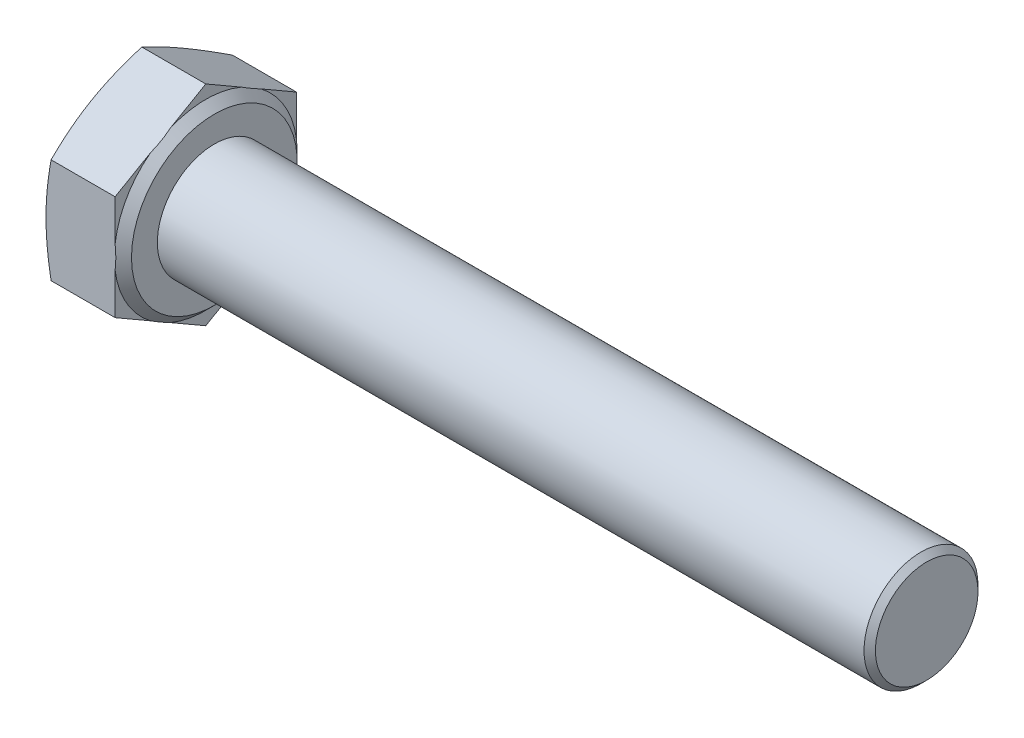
ISO-10303-21;
HEADER;
FILE_DESCRIPTION(('STEP AP214'),'2;1');
FILE_NAME('part.step','',(''),(''),'','','');
FILE_SCHEMA(('AUTOMOTIVE_DESIGN { 1 0 10303 214 1 1 1 1 }'));
ENDSEC;
DATA;
#1=APPLICATION_CONTEXT('core data for automotive mechanical design processes');
#2=APPLICATION_PROTOCOL_DEFINITION('international standard','automotive_design',2000,#1);
#3=PRODUCT_CONTEXT('',#1,'mechanical');
#4=PRODUCT('Part','Part','',(#3));
#5=PRODUCT_RELATED_PRODUCT_CATEGORY('part','',(#4));
#6=PRODUCT_DEFINITION_FORMATION('','',#4);
#7=PRODUCT_DEFINITION_CONTEXT('part definition',#1,'design');
#8=PRODUCT_DEFINITION('design','',#6,#7);
#9=PRODUCT_DEFINITION_SHAPE('','',#8);
#10=(LENGTH_UNIT() NAMED_UNIT(*) SI_UNIT(.MILLI.,.METRE.));
#11=(NAMED_UNIT(*) PLANE_ANGLE_UNIT() SI_UNIT($,.RADIAN.));
#12=(NAMED_UNIT(*) SI_UNIT($,.STERADIAN.) SOLID_ANGLE_UNIT());
#13=UNCERTAINTY_MEASURE_WITH_UNIT(LENGTH_MEASURE(1.E-05),#10,'distance_accuracy_value','');
#14=(GEOMETRIC_REPRESENTATION_CONTEXT(3) GLOBAL_UNCERTAINTY_ASSIGNED_CONTEXT((#13)) GLOBAL_UNIT_ASSIGNED_CONTEXT((#10,
#11,#12)) REPRESENTATION_CONTEXT('',''));
#15=CARTESIAN_POINT('',(0.,0.,0.));
#16=DIRECTION('',(0.,0.,1.));
#17=DIRECTION('',(1.,0.,0.));
#18=AXIS2_PLACEMENT_3D('',#15,#16,#17);
#19=CARTESIAN_POINT('',(5.45,-3.67483446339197,-6.365));
#20=DIRECTION('',(1.,0.,0.));
#21=DIRECTION('',(0.,0.,-1.));
#22=AXIS2_PLACEMENT_3D('',#19,#20,#21);
#23=PLANE('',#22);
#24=CARTESIAN_POINT('',(5.45,0.,0.));
#25=DIRECTION('',(-1.,0.,0.));
#26=DIRECTION('',(0.,0.,1.));
#27=AXIS2_PLACEMENT_3D('',#24,#25,#26);
#28=CIRCLE('',#27,5.815);
#29=CARTESIAN_POINT('',(5.45,0.,5.815));
#30=VERTEX_POINT('',#29);
#31=EDGE_CURVE('E342',#30,#30,#28,.T.);
#32=ORIENTED_EDGE('',*,*,#31,.F.);
#33=EDGE_LOOP('',(#32));
#34=FACE_BOUND('',#33,.T.);
#35=CARTESIAN_POINT('',(5.45,0.,0.));
#36=DIRECTION('',(1.,0.,0.));
#37=DIRECTION('',(0.,0.,-1.));
#38=AXIS2_PLACEMENT_3D('',#35,#36,#37);
#39=CIRCLE('',#38,4.);
#40=CARTESIAN_POINT('',(5.45,0.,-4.));
#41=VERTEX_POINT('',#40);
#42=EDGE_CURVE('E345',#41,#41,#39,.T.);
#43=ORIENTED_EDGE('',*,*,#42,.F.);
#44=EDGE_LOOP('',(#43));
#45=FACE_BOUND('',#44,.T.);
#46=ADVANCED_FACE('F30',(#34,#45),#23,.T.);
#47=CARTESIAN_POINT('',(5.45,-7.34966892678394,0.));
#48=DIRECTION('',(0.,0.866025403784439,0.5));
#49=DIRECTION('',(0.,-0.5,0.866025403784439));
#50=AXIS2_PLACEMENT_3D('',#47,#48,#49);
#51=PLANE('',#50);
#52=CARTESIAN_POINT('',(0.358432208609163,-3.67471899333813,-6.3652));
#53=CARTESIAN_POINT('',(0.303017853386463,-3.82691148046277,-6.10159487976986));
#54=CARTESIAN_POINT('',(0.252608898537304,-3.9796058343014,-5.83712050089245));
#55=CARTESIAN_POINT('',(0.163922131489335,-4.28598738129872,-5.30645209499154));
#56=CARTESIAN_POINT('',(0.125653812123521,-4.43967525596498,-5.0402568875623));
#57=CARTESIAN_POINT('',(0.0637558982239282,-4.74633825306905,-4.50910099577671));
#58=CARTESIAN_POINT('',(0.0399912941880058,-4.8993063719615,-4.24415244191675));
#59=CARTESIAN_POINT('',(0.00811628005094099,-5.2056003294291,-3.71363574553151));
#60=CARTESIAN_POINT('',(0.,-5.35892601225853,-3.44806787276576));
#61=CARTESIAN_POINT('',(0.,-5.66557737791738,-2.91693212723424));
#62=CARTESIAN_POINT('',(0.00811628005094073,-5.81890306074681,-2.65136425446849));
#63=CARTESIAN_POINT('',(0.0399912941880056,-6.12519701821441,-2.12084755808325));
#64=CARTESIAN_POINT('',(0.0637558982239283,-6.27816513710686,-1.85589900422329));
#65=CARTESIAN_POINT('',(0.125653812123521,-6.58482813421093,-1.3247431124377));
#66=CARTESIAN_POINT('',(0.163922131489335,-6.73851600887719,-1.05854790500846));
#67=CARTESIAN_POINT('',(0.252608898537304,-7.04489755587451,-0.527879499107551));
#68=CARTESIAN_POINT('',(0.303017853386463,-7.19759190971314,-0.263405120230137));
#69=CARTESIAN_POINT('',(0.358432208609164,-7.34978439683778,0.000200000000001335));
#70=B_SPLINE_CURVE_WITH_KNOTS('',3,(#52,#53,#54,#55,#56,#57,#58,#59,#60,#61,#62,#63,#64,#65,#66,
#67,#68,#69),.UNSPECIFIED.,.F.,.F.,(4,2,2,2,2,2,2,2,4),(0.,0.928259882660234,1.85724379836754,
2.77744274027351,3.69729643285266,4.6171501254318,5.53734906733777,6.46633298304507,
7.39459286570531),.UNSPECIFIED.);
#71=CARTESIAN_POINT('',(0.358390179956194,-3.67483446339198,-6.365));
#72=VERTEX_POINT('',#71);
#73=CARTESIAN_POINT('',(0.,-5.51225169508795,-3.1825));
#74=VERTEX_POINT('',#73);
#75=EDGE_CURVE('E144',#72,#74,#70,.T.);
#76=ORIENTED_EDGE('',*,*,#75,.F.);
#77=DIRECTION('',(-1.,0.,0.));
#78=VECTOR('',#77,1.);
#79=CARTESIAN_POINT('',(5.45,-3.67483446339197,-6.365));
#80=LINE('',#79,#78);
#81=CARTESIAN_POINT('',(4.85,-3.67483446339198,-6.365));
#82=VERTEX_POINT('',#81);
#83=EDGE_CURVE('E173',#82,#72,#80,.T.);
#84=ORIENTED_EDGE('',*,*,#83,.F.);
#85=DIRECTION('',(0.,0.5,-0.866025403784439));
#86=VECTOR('',#85,1.);
#87=CARTESIAN_POINT('',(4.85,-7.34966892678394,0.));
#88=LINE('',#87,#86);
#89=CARTESIAN_POINT('',(4.85,-5.11256431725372,-3.87477884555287));
#90=VERTEX_POINT('',#89);
#91=EDGE_CURVE('E382',#90,#82,#88,.T.);
#92=ORIENTED_EDGE('',*,*,#91,.F.);
#93=CARTESIAN_POINT('',(4.8498,-5.91274078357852,-2.48883255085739));
#94=CARTESIAN_POINT('',(4.86645104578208,-5.84620990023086,-2.60406742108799));
#95=CARTESIAN_POINT('',(4.8790176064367,-5.77941769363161,-2.71975491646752));
#96=CARTESIAN_POINT('',(4.8957758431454,-5.64583354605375,-2.95112944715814));
#97=CARTESIAN_POINT('',(4.9,-5.57904262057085,-3.06681472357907));
#98=CARTESIAN_POINT('',(4.9,-5.44546076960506,-3.29818527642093));
#99=CARTESIAN_POINT('',(4.8957758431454,-5.37866984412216,-3.41387055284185));
#100=CARTESIAN_POINT('',(4.8790176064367,-5.2450856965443,-3.64524508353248));
#101=CARTESIAN_POINT('',(4.86645104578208,-5.17829348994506,-3.76093257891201));
#102=CARTESIAN_POINT('',(4.8498,-5.11176260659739,-3.87616744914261));
#103=B_SPLINE_CURVE_WITH_KNOTS('',3,(#93,#94,#95,#96,#97,#98,#99,#100,#101,#102),.UNSPECIFIED.,
.F.,.F.,(4,2,2,2,4),(0.,0.402253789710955,0.802938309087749,1.20362282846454,1.6058766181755),.UNSPECIFIED.);
#104=CARTESIAN_POINT('',(4.85,-5.91193907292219,-2.49022115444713));
#105=VERTEX_POINT('',#104);
#106=EDGE_CURVE('E279',#105,#90,#103,.T.);
#107=ORIENTED_EDGE('',*,*,#106,.F.);
#108=CARTESIAN_POINT('',(4.85,-7.34966892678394,0.));
#109=VERTEX_POINT('',#108);
#110=EDGE_CURVE('E387',#109,#105,#88,.T.);
#111=ORIENTED_EDGE('',*,*,#110,.F.);
#112=DIRECTION('',(-1.,0.,0.));
#113=VECTOR('',#112,1.);
#114=CARTESIAN_POINT('',(5.45,-7.34966892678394,0.));
#115=LINE('',#114,#113);
#116=CARTESIAN_POINT('',(0.358390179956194,-7.34966892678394,0.));
#117=VERTEX_POINT('',#116);
#118=EDGE_CURVE('E167',#109,#117,#115,.T.);
#119=ORIENTED_EDGE('',*,*,#118,.T.);
#120=EDGE_CURVE('E198',#74,#117,#70,.T.);
#121=ORIENTED_EDGE('',*,*,#120,.F.);
#122=EDGE_LOOP('',(#76,#84,#92,#107,#111,#119,#121));
#123=FACE_BOUND('',#122,.T.);
#124=ADVANCED_FACE('F213',(#123),#51,.F.);
#125=CARTESIAN_POINT('',(5.45,-3.67483446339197,-6.365));
#126=DIRECTION('',(0.,0.,1.));
#127=DIRECTION('',(0.,-1.,0.));
#128=AXIS2_PLACEMENT_3D('',#125,#126,#127);
#129=PLANE('',#128);
#130=CARTESIAN_POINT('',(1.9150953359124,-9.72967062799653,-6.365));
#131=CARTESIAN_POINT('',(1.82740685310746,-9.44169496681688,-6.365));
#132=CARTESIAN_POINT('',(1.74074158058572,-9.15340194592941,-6.365));
#133=CARTESIAN_POINT('',(1.57002349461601,-8.57601961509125,-6.365));
#134=CARTESIAN_POINT('',(1.48597088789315,-8.28693024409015,-6.365));
#135=CARTESIAN_POINT('',(1.320904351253,-7.70729883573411,-6.365));
#136=CARTESIAN_POINT('',(1.23989638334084,-7.41675509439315,-6.365));
#137=CARTESIAN_POINT('',(1.08186750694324,-6.83458682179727,-6.365));
#138=CARTESIAN_POINT('',(1.0048465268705,-6.54296231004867,-6.365));
#139=CARTESIAN_POINT('',(0.856698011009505,-5.96204179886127,-6.365));
#140=CARTESIAN_POINT('',(0.785509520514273,-5.67276142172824,-6.365));
#141=CARTESIAN_POINT('',(0.64919338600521,-5.09276117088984,-6.365));
#142=CARTESIAN_POINT('',(0.584065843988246,-4.80204127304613,-6.365));
#143=CARTESIAN_POINT('',(0.46138999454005,-4.21909692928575,-6.365));
#144=CARTESIAN_POINT('',(0.40383910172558,-3.92687303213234,-6.365));
#145=CARTESIAN_POINT('',(0.298068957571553,-3.34072867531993,-6.365));
#146=CARTESIAN_POINT('',(0.249849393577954,-3.04680827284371,-6.365));
#147=CARTESIAN_POINT('',(0.169475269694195,-2.49036754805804,-6.365));
#148=CARTESIAN_POINT('',(0.136125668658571,-2.22802146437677,-6.365));
#149=CARTESIAN_POINT('',(0.0796727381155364,-1.70221996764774,-6.365));
#150=CARTESIAN_POINT('',(0.0565691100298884,-1.43876458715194,-6.365));
#151=CARTESIAN_POINT('',(0.0217207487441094,-0.911278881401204,-6.365));
#152=CARTESIAN_POINT('',(0.00996798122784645,-0.64724909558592,-6.365));
#153=CARTESIAN_POINT('',(-0.00158361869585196,-0.11892536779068,-6.365));
#154=CARTESIAN_POINT('',(-0.00138253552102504,0.145368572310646,-6.365));
#155=CARTESIAN_POINT('',(0.0109939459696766,0.675012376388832,-6.365));
#156=CARTESIAN_POINT('',(0.0232300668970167,0.940360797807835,-6.365));
#157=CARTESIAN_POINT('',(0.0591135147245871,1.47027824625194,-6.365));
#158=CARTESIAN_POINT('',(0.0827611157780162,1.73484725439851,-6.365));
#159=CARTESIAN_POINT('',(0.14036130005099,2.26307523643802,-6.365));
#160=CARTESIAN_POINT('',(0.174322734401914,2.52673323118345,-6.365));
#161=CARTESIAN_POINT('',(0.251173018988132,3.0527302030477,-6.365));
#162=CARTESIAN_POINT('',(0.294061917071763,3.31506917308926,-6.365));
#163=CARTESIAN_POINT('',(0.389839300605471,3.85223310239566,-6.365));
#164=CARTESIAN_POINT('',(0.443136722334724,4.12698449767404,-6.365));
#165=CARTESIAN_POINT('',(0.556591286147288,4.67507636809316,-6.365));
#166=CARTESIAN_POINT('',(0.616748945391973,4.94841673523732,-6.365));
#167=CARTESIAN_POINT('',(0.742660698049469,5.49388136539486,-6.365));
#168=CARTESIAN_POINT('',(0.808416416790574,5.7660052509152,-6.365));
#169=CARTESIAN_POINT('',(0.944454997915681,6.30910658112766,-6.365));
#170=CARTESIAN_POINT('',(1.01473775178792,6.58008405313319,-6.365));
#171=CARTESIAN_POINT('',(1.15907513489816,7.1214003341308,-6.365));
#172=CARTESIAN_POINT('',(1.23313447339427,7.39173788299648,-6.365));
#173=CARTESIAN_POINT('',(1.38427063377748,7.93156975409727,-6.365));
#174=CARTESIAN_POINT('',(1.46134750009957,8.20106406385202,-6.365));
#175=CARTESIAN_POINT('',(1.69623888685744,9.00837522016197,-6.365));
#176=CARTESIAN_POINT('',(1.85774082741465,9.5451184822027,-6.365));
#177=CARTESIAN_POINT('',(2.18566531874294,10.6106004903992,-6.365));
#178=CARTESIAN_POINT('',(2.35201388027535,11.1393621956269,-6.365));
#179=CARTESIAN_POINT('',(2.68943698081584,12.1954003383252,-6.365));
#180=CARTESIAN_POINT('',(2.86051174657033,12.7226767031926,-6.365));
#181=CARTESIAN_POINT('',(3.20545948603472,13.7740950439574,-6.365));
#182=CARTESIAN_POINT('',(3.37931937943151,14.298241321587,-6.365));
#183=CARTESIAN_POINT('',(3.64203864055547,15.0837906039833,-6.365));
#184=CARTESIAN_POINT('',(3.72992971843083,15.3455181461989,-6.365));
#185=CARTESIAN_POINT('',(3.90628058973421,15.8687808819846,-6.365));
#186=CARTESIAN_POINT('',(3.99474038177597,16.1303160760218,-6.365));
#187=CARTESIAN_POINT('',(4.08344640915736,16.3917677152,-6.365));
#188=B_SPLINE_CURVE_WITH_KNOTS('',3,(#130,#131,#132,#133,#134,#135,#136,#137,#138,#139,#140,
#141,#142,#143,#144,#145,#146,#147,#148,#149,#150,#151,#152,#153,#154,#155,#156,#157,#158,#159,
#160,#161,#162,#163,#164,#165,#166,#167,#168,#169,#170,#171,#172,#173,#174,#175,#176,#177,#178,
#179,#180,#181,#182,#183,#184,#185,#186,#187),.UNSPECIFIED.,.F.,.F.,(4,2,2,2,2,2,2,2,2,2,2,2,2,
2,2,2,2,2,2,2,2,2,2,2,2,2,2,2,4),(0.,0.903097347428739,1.8062659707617,2.7111196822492,
3.61595714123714,4.50963841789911,5.4033347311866,6.29672529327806,7.19008591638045,
7.98328363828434,8.77645824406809,9.56907101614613,10.361678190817,11.1583050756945,
11.9549510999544,12.7522827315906,13.5496186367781,14.3891305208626,15.2287057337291,
16.0685255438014,16.9083252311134,17.7491990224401,18.5900852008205,20.271552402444,
21.9344598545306,23.5974472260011,25.2541246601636,26.0823966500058,26.9106666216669),.UNSPECIFIED.);
#189=CARTESIAN_POINT('',(0.358390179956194,3.67483446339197,-6.36500000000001));
#190=VERTEX_POINT('',#189);
#191=CARTESIAN_POINT('',(0.,0.,-6.365));
#192=VERTEX_POINT('',#191);
#193=EDGE_CURVE('E258',#190,#192,#188,.F.);
#194=ORIENTED_EDGE('',*,*,#193,.F.);
#195=DIRECTION('',(-1.,0.,0.));
#196=VECTOR('',#195,1.);
#197=CARTESIAN_POINT('',(5.45,3.67483446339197,-6.365));
#198=LINE('',#197,#196);
#199=CARTESIAN_POINT('',(4.85,3.67483446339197,-6.365));
#200=VERTEX_POINT('',#199);
#201=EDGE_CURVE('E164',#200,#190,#198,.T.);
#202=ORIENTED_EDGE('',*,*,#201,.F.);
#203=DIRECTION('',(0.,1.,0.));
#204=VECTOR('',#203,1.);
#205=CARTESIAN_POINT('',(4.85,-3.67483446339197,-6.365));
#206=LINE('',#205,#204);
#207=CARTESIAN_POINT('',(4.85,0.7993747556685,-6.365));
#208=VERTEX_POINT('',#207);
#209=EDGE_CURVE('E388',#208,#200,#206,.T.);
#210=ORIENTED_EDGE('',*,*,#209,.F.);
#211=CARTESIAN_POINT('',(4.03279951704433,-3.43387519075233,-6.365));
#212=CARTESIAN_POINT('',(4.12915263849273,-3.23085023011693,-6.365));
#213=CARTESIAN_POINT('',(4.22025748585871,-3.02511909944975,-6.365));
#214=CARTESIAN_POINT('',(4.38924442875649,-2.607586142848,-6.365));
#215=CARTESIAN_POINT('',(4.46708471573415,-2.39576749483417,-6.365));
#216=CARTESIAN_POINT('',(4.60570873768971,-1.96811964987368,-6.365));
#217=CARTESIAN_POINT('',(4.66660505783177,-1.75232760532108,-6.365));
#218=CARTESIAN_POINT('',(4.76875528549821,-1.31633465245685,-6.365));
#219=CARTESIAN_POINT('',(4.81003455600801,-1.09613982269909,-6.365));
#220=CARTESIAN_POINT('',(4.86166598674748,-0.716857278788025,-6.365));
#221=CARTESIAN_POINT('',(4.87750915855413,-0.558507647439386,-6.365));
#222=CARTESIAN_POINT('',(4.89740688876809,-0.241033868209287,-6.365));
#223=CARTESIAN_POINT('',(4.90146005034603,-0.0819096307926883,-6.365));
#224=CARTESIAN_POINT('',(4.89760366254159,0.236307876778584,-6.365));
#225=CARTESIAN_POINT('',(4.8896854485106,0.395401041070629,-6.365));
#226=CARTESIAN_POINT('',(4.86219166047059,0.712536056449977,-6.365));
#227=CARTESIAN_POINT('',(4.84261749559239,0.870578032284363,-6.365));
#228=CARTESIAN_POINT('',(4.77989629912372,1.26397857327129,-6.365));
#229=CARTESIAN_POINT('',(4.72984501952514,1.49825109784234,-6.365));
#230=CARTESIAN_POINT('',(4.60840439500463,1.96142866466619,-6.365));
#231=CARTESIAN_POINT('',(4.53698240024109,2.19032491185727,-6.365));
#232=CARTESIAN_POINT('',(4.37639278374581,2.64284924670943,-6.365));
#233=CARTESIAN_POINT('',(4.28714977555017,2.86645027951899,-6.365));
#234=CARTESIAN_POINT('',(4.14298757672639,3.1968115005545,-6.365));
#235=CARTESIAN_POINT('',(4.09331043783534,3.30591051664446,-6.365));
#236=CARTESIAN_POINT('',(3.99087238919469,3.52261302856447,-6.365));
#237=CARTESIAN_POINT('',(3.93811240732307,3.63021696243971,-6.365));
#238=CARTESIAN_POINT('',(3.88398571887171,3.73713082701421,-6.365));
#239=B_SPLINE_CURVE_WITH_KNOTS('',3,(#211,#212,#213,#214,#215,#216,#217,#218,#219,#220,#221,
#222,#223,#224,#225,#226,#227,#228,#229,#230,#231,#232,#233,#234,#235,#236,#237,#238),
.UNSPECIFIED.,.F.,.F.,(4,2,2,2,2,2,2,2,2,2,2,2,2,4),(0.,0.67440515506,1.35089815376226,
2.02278254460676,2.69379587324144,3.17081389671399,3.64788843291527,4.1253084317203,
4.60267072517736,5.32008921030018,6.03860940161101,6.76023604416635,7.11982798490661,
7.47931224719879),.UNSPECIFIED.);
#240=CARTESIAN_POINT('',(4.85,-0.799374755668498,-6.365));
#241=VERTEX_POINT('',#240);
#242=EDGE_CURVE('E273',#241,#208,#239,.T.);
#243=ORIENTED_EDGE('',*,*,#242,.F.);
#244=EDGE_CURVE('E384',#82,#241,#206,.T.);
#245=ORIENTED_EDGE('',*,*,#244,.F.);
#246=ORIENTED_EDGE('',*,*,#83,.T.);
#247=EDGE_CURVE('E155',#192,#72,#188,.F.);
#248=ORIENTED_EDGE('',*,*,#247,.F.);
#249=EDGE_LOOP('',(#194,#202,#210,#243,#245,#246,#248));
#250=FACE_BOUND('',#249,.T.);
#251=ADVANCED_FACE('F265',(#250),#129,.F.);
#252=CARTESIAN_POINT('',(5.45,3.67483446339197,-6.365));
#253=DIRECTION('',(0.,-0.866025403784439,0.5));
#254=DIRECTION('',(0.,-0.5,-0.866025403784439));
#255=AXIS2_PLACEMENT_3D('',#252,#253,#254);
#256=PLANE('',#255);
#257=CARTESIAN_POINT('',(0.358432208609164,7.34978439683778,0.000200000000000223));
#258=CARTESIAN_POINT('',(0.303017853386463,7.19759190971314,-0.263405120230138));
#259=CARTESIAN_POINT('',(0.252608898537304,7.04489755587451,-0.527879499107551));
#260=CARTESIAN_POINT('',(0.163922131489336,6.73851600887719,-1.05854790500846));
#261=CARTESIAN_POINT('',(0.125653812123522,6.58482813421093,-1.3247431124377));
#262=CARTESIAN_POINT('',(0.0637558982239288,6.27816513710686,-1.85589900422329));
#263=CARTESIAN_POINT('',(0.0399912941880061,6.12519701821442,-2.12084755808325));
#264=CARTESIAN_POINT('',(0.00811628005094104,5.81890306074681,-2.65136425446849));
#265=CARTESIAN_POINT('',(0.,5.66557737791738,-2.91693212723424));
#266=CARTESIAN_POINT('',(0.,5.35892601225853,-3.44806787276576));
#267=CARTESIAN_POINT('',(0.00811628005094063,5.2056003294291,-3.71363574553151));
#268=CARTESIAN_POINT('',(0.0399912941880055,4.8993063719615,-4.24415244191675));
#269=CARTESIAN_POINT('',(0.0637558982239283,4.74633825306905,-4.50910099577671));
#270=CARTESIAN_POINT('',(0.125653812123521,4.43967525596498,-5.0402568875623));
#271=CARTESIAN_POINT('',(0.163922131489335,4.28598738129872,-5.30645209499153));
#272=CARTESIAN_POINT('',(0.252608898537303,3.9796058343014,-5.83712050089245));
#273=CARTESIAN_POINT('',(0.303017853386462,3.82691148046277,-6.10159487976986));
#274=CARTESIAN_POINT('',(0.358432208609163,3.67471899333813,-6.3652));
#275=B_SPLINE_CURVE_WITH_KNOTS('',3,(#257,#258,#259,#260,#261,#262,#263,#264,#265,#266,#267,
#268,#269,#270,#271,#272,#273,#274),.UNSPECIFIED.,.F.,.F.,(4,2,2,2,2,2,2,2,4),(0.,
0.928259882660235,1.85724379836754,2.77744274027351,3.69729643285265,4.6171501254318,
5.53734906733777,6.46633298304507,7.39459286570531),.UNSPECIFIED.);
#276=CARTESIAN_POINT('',(0.358390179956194,7.34966892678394,0.));
#277=VERTEX_POINT('',#276);
#278=CARTESIAN_POINT('',(0.,5.51225169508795,-3.1825));
#279=VERTEX_POINT('',#278);
#280=EDGE_CURVE('E45',#277,#279,#275,.T.);
#281=ORIENTED_EDGE('',*,*,#280,.F.);
#282=DIRECTION('',(-1.,0.,0.));
#283=VECTOR('',#282,1.);
#284=CARTESIAN_POINT('',(5.45,7.34966892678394,0.));
#285=LINE('',#284,#283);
#286=CARTESIAN_POINT('',(4.85,7.34966892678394,0.));
#287=VERTEX_POINT('',#286);
#288=EDGE_CURVE('E161',#287,#277,#285,.T.);
#289=ORIENTED_EDGE('',*,*,#288,.F.);
#290=DIRECTION('',(0.,0.5,0.866025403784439));
#291=VECTOR('',#290,1.);
#292=CARTESIAN_POINT('',(4.85,3.67483446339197,-6.365));
#293=LINE('',#292,#291);
#294=CARTESIAN_POINT('',(4.85,5.91193907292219,-2.49022115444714));
#295=VERTEX_POINT('',#294);
#296=EDGE_CURVE('E412',#295,#287,#293,.T.);
#297=ORIENTED_EDGE('',*,*,#296,.F.);
#298=CARTESIAN_POINT('',(4.8498,5.11176260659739,-3.87616744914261));
#299=CARTESIAN_POINT('',(4.86645104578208,5.17829348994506,-3.76093257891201));
#300=CARTESIAN_POINT('',(4.8790176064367,5.2450856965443,-3.64524508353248));
#301=CARTESIAN_POINT('',(4.8957758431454,5.37866984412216,-3.41387055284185));
#302=CARTESIAN_POINT('',(4.9,5.44546076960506,-3.29818527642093));
#303=CARTESIAN_POINT('',(4.9,5.57904262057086,-3.06681472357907));
#304=CARTESIAN_POINT('',(4.8957758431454,5.64583354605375,-2.95112944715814));
#305=CARTESIAN_POINT('',(4.8790176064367,5.77941769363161,-2.71975491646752));
#306=CARTESIAN_POINT('',(4.86645104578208,5.84620990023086,-2.60406742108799));
#307=CARTESIAN_POINT('',(4.8498,5.91274078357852,-2.48883255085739));
#308=B_SPLINE_CURVE_WITH_KNOTS('',3,(#298,#299,#300,#301,#302,#303,#304,#305,#306,#307),
.UNSPECIFIED.,.F.,.F.,(4,2,2,2,4),(0.,0.402253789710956,0.80293830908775,1.20362282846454,
1.6058766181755),.UNSPECIFIED.);
#309=CARTESIAN_POINT('',(4.85,5.11256431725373,-3.87477884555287));
#310=VERTEX_POINT('',#309);
#311=EDGE_CURVE('E280',#310,#295,#308,.T.);
#312=ORIENTED_EDGE('',*,*,#311,.F.);
#313=EDGE_CURVE('E407',#200,#310,#293,.T.);
#314=ORIENTED_EDGE('',*,*,#313,.F.);
#315=ORIENTED_EDGE('',*,*,#201,.T.);
#316=EDGE_CURVE('E259',#279,#190,#275,.T.);
#317=ORIENTED_EDGE('',*,*,#316,.F.);
#318=EDGE_LOOP('',(#281,#289,#297,#312,#314,#315,#317));
#319=FACE_BOUND('',#318,.T.);
#320=ADVANCED_FACE('F268',(#319),#256,.F.);
#321=CARTESIAN_POINT('',(5.45,7.34966892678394,0.));
#322=DIRECTION('',(0.,-0.866025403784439,-0.5));
#323=DIRECTION('',(0.,0.5,-0.866025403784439));
#324=AXIS2_PLACEMENT_3D('',#321,#322,#323);
#325=PLANE('',#324);
#326=CARTESIAN_POINT('',(0.358432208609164,3.67471899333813,6.3652));
#327=CARTESIAN_POINT('',(0.303017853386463,3.82691148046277,6.10159487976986));
#328=CARTESIAN_POINT('',(0.252608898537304,3.9796058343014,5.83712050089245));
#329=CARTESIAN_POINT('',(0.163922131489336,4.28598738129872,5.30645209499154));
#330=CARTESIAN_POINT('',(0.125653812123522,4.43967525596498,5.0402568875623));
#331=CARTESIAN_POINT('',(0.0637558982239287,4.74633825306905,4.50910099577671));
#332=CARTESIAN_POINT('',(0.0399912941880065,4.8993063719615,4.24415244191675));
#333=CARTESIAN_POINT('',(0.00811628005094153,5.2056003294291,3.71363574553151));
#334=CARTESIAN_POINT('',(0.,5.35892601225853,3.44806787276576));
#335=CARTESIAN_POINT('',(0.,5.66557737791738,2.91693212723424));
#336=CARTESIAN_POINT('',(0.0081162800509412,5.81890306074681,2.65136425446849));
#337=CARTESIAN_POINT('',(0.0399912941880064,6.12519701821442,2.12084755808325));
#338=CARTESIAN_POINT('',(0.0637558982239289,6.27816513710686,1.85589900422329));
#339=CARTESIAN_POINT('',(0.125653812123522,6.58482813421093,1.3247431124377));
#340=CARTESIAN_POINT('',(0.163922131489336,6.73851600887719,1.05854790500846));
#341=CARTESIAN_POINT('',(0.252608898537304,7.04489755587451,0.527879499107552));
#342=CARTESIAN_POINT('',(0.303017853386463,7.19759190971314,0.263405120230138));
#343=CARTESIAN_POINT('',(0.358432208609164,7.34978439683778,-0.00020000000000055));
#344=B_SPLINE_CURVE_WITH_KNOTS('',3,(#326,#327,#328,#329,#330,#331,#332,#333,#334,#335,#336,
#337,#338,#339,#340,#341,#342,#343),.UNSPECIFIED.,.F.,.F.,(4,2,2,2,2,2,2,2,4),(0.,
0.928259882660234,1.85724379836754,2.77744274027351,3.69729643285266,4.6171501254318,
5.53734906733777,6.46633298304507,7.39459286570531),.UNSPECIFIED.);
#345=CARTESIAN_POINT('',(0.358390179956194,3.67483446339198,6.365));
#346=VERTEX_POINT('',#345);
#347=CARTESIAN_POINT('',(0.,5.51225169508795,3.1825));
#348=VERTEX_POINT('',#347);
#349=EDGE_CURVE('E53',#346,#348,#344,.T.);
#350=ORIENTED_EDGE('',*,*,#349,.F.);
#351=DIRECTION('',(-1.,0.,0.));
#352=VECTOR('',#351,1.);
#353=CARTESIAN_POINT('',(5.45,3.67483446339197,6.365));
#354=LINE('',#353,#352);
#355=CARTESIAN_POINT('',(4.85,3.67483446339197,6.365));
#356=VERTEX_POINT('',#355);
#357=EDGE_CURVE('E152',#356,#346,#354,.T.);
#358=ORIENTED_EDGE('',*,*,#357,.F.);
#359=DIRECTION('',(0.,-0.5,0.866025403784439));
#360=VECTOR('',#359,1.);
#361=CARTESIAN_POINT('',(4.85,7.34966892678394,0.));
#362=LINE('',#361,#360);
#363=CARTESIAN_POINT('',(4.85,5.11256431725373,3.87477884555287));
#364=VERTEX_POINT('',#363);
#365=EDGE_CURVE('E419',#364,#356,#362,.T.);
#366=ORIENTED_EDGE('',*,*,#365,.F.);
#367=CARTESIAN_POINT('',(4.8498,5.91274078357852,2.48883255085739));
#368=CARTESIAN_POINT('',(4.86645104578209,5.84620990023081,2.60406742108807));
#369=CARTESIAN_POINT('',(4.87901760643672,5.77941769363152,2.71975491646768));
#370=CARTESIAN_POINT('',(4.89577584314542,5.64583354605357,2.95112944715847));
#371=CARTESIAN_POINT('',(4.90000000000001,5.57904262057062,3.06681472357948));
#372=CARTESIAN_POINT('',(4.89999999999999,5.44546076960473,3.29818527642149));
#373=CARTESIAN_POINT('',(4.89577584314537,5.37866984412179,3.4138705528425));
#374=CARTESIAN_POINT('',(4.87901760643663,5.24508569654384,3.64524508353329));
#375=CARTESIAN_POINT('',(4.86645104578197,5.17829348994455,3.7609325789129));
#376=CARTESIAN_POINT('',(4.84979999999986,5.11176260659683,3.87616744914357));
#377=B_SPLINE_CURVE_WITH_KNOTS('',3,(#367,#368,#369,#370,#371,#372,#373,#374,#375,#376),
.UNSPECIFIED.,.F.,.F.,(4,2,2,2,4),(0.,0.402253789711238,0.802938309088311,1.20362282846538,
1.60587661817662),.UNSPECIFIED.);
#378=CARTESIAN_POINT('',(4.85,5.91193907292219,2.49022115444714));
#379=VERTEX_POINT('',#378);
#380=EDGE_CURVE('E312',#379,#364,#377,.T.);
#381=ORIENTED_EDGE('',*,*,#380,.F.);
#382=EDGE_CURVE('E418',#287,#379,#362,.T.);
#383=ORIENTED_EDGE('',*,*,#382,.F.);
#384=ORIENTED_EDGE('',*,*,#288,.T.);
#385=EDGE_CURVE('E154',#348,#277,#344,.T.);
#386=ORIENTED_EDGE('',*,*,#385,.F.);
#387=EDGE_LOOP('',(#350,#358,#366,#381,#383,#384,#386));
#388=FACE_BOUND('',#387,.T.);
#389=ADVANCED_FACE('F150',(#388),#325,.F.);
#390=CARTESIAN_POINT('',(5.45,3.67483446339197,6.365));
#391=DIRECTION('',(0.,0.,-1.));
#392=DIRECTION('',(-1.,0.,0.));
#393=AXIS2_PLACEMENT_3D('',#390,#391,#392);
#394=PLANE('',#393);
#395=CARTESIAN_POINT('',(1.91509499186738,-9.72966949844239,6.365));
#396=CARTESIAN_POINT('',(1.8274065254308,-9.44169388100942,6.365));
#397=CARTESIAN_POINT('',(1.74074126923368,-9.15340090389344,6.365));
#398=CARTESIAN_POINT('',(1.57002321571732,-8.57601866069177,6.365));
#399=CARTESIAN_POINT('',(1.48597062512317,-8.28692933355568,6.365));
#400=CARTESIAN_POINT('',(1.32090412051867,-7.70729801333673,6.365));
#401=CARTESIAN_POINT('',(1.23989616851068,-7.41675431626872,6.365));
#402=CARTESIAN_POINT('',(1.08186732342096,-6.83458613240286,6.365));
#403=CARTESIAN_POINT('',(1.00484635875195,-6.54296166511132,6.365));
#404=CARTESIAN_POINT('',(0.856697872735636,-5.96204124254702,6.365));
#405=CARTESIAN_POINT('',(0.785509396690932,-5.67276090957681,6.365));
#406=CARTESIAN_POINT('',(0.64919328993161,-5.09276074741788,6.365));
#407=CARTESIAN_POINT('',(0.584065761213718,-4.80204089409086,6.365));
#408=CARTESIAN_POINT('',(0.461389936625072,-4.21909663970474,6.365));
#409=CARTESIAN_POINT('',(0.403839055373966,-3.92687278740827,6.365));
#410=CARTESIAN_POINT('',(0.2980689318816,-3.34072852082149,6.365));
#411=CARTESIAN_POINT('',(0.249849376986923,-3.04680816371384,6.365));
#412=CARTESIAN_POINT('',(0.169475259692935,-2.49036747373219,6.365));
#413=CARTESIAN_POINT('',(0.136125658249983,-2.22802137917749,6.365));
#414=CARTESIAN_POINT('',(0.0796727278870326,-1.7022198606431,6.365));
#415=CARTESIAN_POINT('',(0.0565691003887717,-1.43876446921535,6.365));
#416=CARTESIAN_POINT('',(0.021720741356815,-0.911278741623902,6.365));
#417=CARTESIAN_POINT('',(0.00996797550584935,-0.647248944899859,6.365));
#418=CARTESIAN_POINT('',(-0.00158362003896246,-0.118925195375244,6.365));
#419=CARTESIAN_POINT('',(-0.00138253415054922,0.145368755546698,6.365));
#420=CARTESIAN_POINT('',(0.0109939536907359,0.675012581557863,6.365));
#421=CARTESIAN_POINT('',(0.0232300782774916,0.940361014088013,6.365));
#422=CARTESIAN_POINT('',(0.05911353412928,1.4702784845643,6.365));
#423=CARTESIAN_POINT('',(0.0827611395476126,1.7348475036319,6.365));
#424=CARTESIAN_POINT('',(0.140361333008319,2.26307550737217,6.365));
#425=CARTESIAN_POINT('',(0.174322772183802,2.52673351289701,6.365));
#426=CARTESIAN_POINT('',(0.251173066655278,3.05273050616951,6.365));
#427=CARTESIAN_POINT('',(0.294061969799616,3.3150694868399,6.365));
#428=CARTESIAN_POINT('',(0.389839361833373,3.85223342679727,6.365));
#429=CARTESIAN_POINT('',(0.443136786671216,4.1269848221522,6.365));
#430=CARTESIAN_POINT('',(0.556591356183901,4.6750766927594,6.365));
#431=CARTESIAN_POINT('',(0.616749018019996,4.94841706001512,6.365));
#432=CARTESIAN_POINT('',(0.742660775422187,5.49388169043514,6.365));
#433=CARTESIAN_POINT('',(0.808416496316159,5.76600557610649,6.365));
#434=CARTESIAN_POINT('',(0.944455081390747,6.30910690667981,6.365));
#435=CARTESIAN_POINT('',(1.01473783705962,6.58008437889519,6.365));
#436=CARTESIAN_POINT('',(1.15907522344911,7.12140066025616,6.365));
#437=CARTESIAN_POINT('',(1.23313456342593,7.39173820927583,6.365));
#438=CARTESIAN_POINT('',(1.38427072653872,7.93157008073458,6.365));
#439=CARTESIAN_POINT('',(1.46134759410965,8.20106439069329,6.365));
#440=CARTESIAN_POINT('',(1.6962389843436,9.00837554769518,6.365));
#441=CARTESIAN_POINT('',(1.85774092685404,9.54511881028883,6.365));
#442=CARTESIAN_POINT('',(2.18566542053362,10.6106008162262,6.365));
#443=CARTESIAN_POINT('',(2.35201398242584,11.1393625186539,6.365));
#444=CARTESIAN_POINT('',(2.6894370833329,12.1954006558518,6.365));
#445=CARTESIAN_POINT('',(2.86051184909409,12.7226770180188,6.365));
#446=CARTESIAN_POINT('',(3.2054595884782,13.7740953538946,6.365));
#447=CARTESIAN_POINT('',(3.37931948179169,14.2982416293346,6.365));
#448=CARTESIAN_POINT('',(3.64203874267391,15.0837909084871,6.365));
#449=CARTESIAN_POINT('',(3.72992982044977,15.3455184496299,6.365));
#450=CARTESIAN_POINT('',(3.90628069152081,15.8687811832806,6.365));
#451=CARTESIAN_POINT('',(3.99474048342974,16.1303163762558,6.365));
#452=CARTESIAN_POINT('',(4.08344651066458,16.3917680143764,6.365));
#453=B_SPLINE_CURVE_WITH_KNOTS('',3,(#395,#396,#397,#398,#399,#400,#401,#402,#403,#404,#405,
#406,#407,#408,#409,#410,#411,#412,#413,#414,#415,#416,#417,#418,#419,#420,#421,#422,#423,#424,
#425,#426,#427,#428,#429,#430,#431,#432,#433,#434,#435,#436,#437,#438,#439,#440,#441,#442,#443,
#444,#445,#446,#447,#448,#449,#450,#451,#452),.UNSPECIFIED.,.F.,.F.,(4,2,2,2,2,2,2,2,2,2,2,2,2,
2,2,2,2,2,2,2,2,2,2,2,2,2,2,2,4),(0.,0.903097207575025,1.80626569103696,2.71111926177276,
3.61595658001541,4.50963771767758,5.40333389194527,6.29672431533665,7.19008479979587,
7.98328255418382,8.77645719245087,9.56906999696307,10.3616772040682,11.1583041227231,
11.9549501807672,12.7522818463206,13.5496177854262,14.3891296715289,15.2287048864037,
16.0685246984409,16.9083243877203,17.7491981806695,18.5900843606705,20.2715515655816,
21.9344590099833,23.5974463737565,25.2541238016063,26.0823957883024,26.9106657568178),.UNSPECIFIED.);
#454=CARTESIAN_POINT('',(0.358390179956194,-3.67483446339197,6.36500000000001));
#455=VERTEX_POINT('',#454);
#456=CARTESIAN_POINT('',(0.,0.,6.365));
#457=VERTEX_POINT('',#456);
#458=EDGE_CURVE('E146',#455,#457,#453,.T.);
#459=ORIENTED_EDGE('',*,*,#458,.F.);
#460=DIRECTION('',(-1.,0.,0.));
#461=VECTOR('',#460,1.);
#462=CARTESIAN_POINT('',(5.45,-3.67483446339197,6.365));
#463=LINE('',#462,#461);
#464=CARTESIAN_POINT('',(4.85,-3.67483446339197,6.36500000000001));
#465=VERTEX_POINT('',#464);
#466=EDGE_CURVE('E162',#465,#455,#463,.T.);
#467=ORIENTED_EDGE('',*,*,#466,.F.);
#468=DIRECTION('',(0.,-1.,0.));
#469=VECTOR('',#468,1.);
#470=CARTESIAN_POINT('',(4.85,3.67483446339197,6.365));
#471=LINE('',#470,#469);
#472=CARTESIAN_POINT('',(4.85,-0.799374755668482,6.365));
#473=VERTEX_POINT('',#472);
#474=EDGE_CURVE('E359',#473,#465,#471,.T.);
#475=ORIENTED_EDGE('',*,*,#474,.F.);
#476=CARTESIAN_POINT('',(4.03279951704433,-3.43387519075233,6.365));
#477=CARTESIAN_POINT('',(4.12915263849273,-3.23085023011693,6.365));
#478=CARTESIAN_POINT('',(4.22025748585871,-3.02511909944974,6.365));
#479=CARTESIAN_POINT('',(4.38924442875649,-2.607586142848,6.365));
#480=CARTESIAN_POINT('',(4.46708471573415,-2.39576749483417,6.365));
#481=CARTESIAN_POINT('',(4.60570873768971,-1.96811964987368,6.365));
#482=CARTESIAN_POINT('',(4.66660505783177,-1.75232760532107,6.365));
#483=CARTESIAN_POINT('',(4.76875528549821,-1.31633465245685,6.365));
#484=CARTESIAN_POINT('',(4.81003455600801,-1.09613982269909,6.365));
#485=CARTESIAN_POINT('',(4.86166598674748,-0.716857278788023,6.365));
#486=CARTESIAN_POINT('',(4.87750915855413,-0.558507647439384,6.365));
#487=CARTESIAN_POINT('',(4.89740688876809,-0.241033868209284,6.365));
#488=CARTESIAN_POINT('',(4.90146005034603,-0.0819096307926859,6.365));
#489=CARTESIAN_POINT('',(4.89760366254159,0.236307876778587,6.365));
#490=CARTESIAN_POINT('',(4.8896854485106,0.395401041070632,6.365));
#491=CARTESIAN_POINT('',(4.86219166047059,0.712536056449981,6.365));
#492=CARTESIAN_POINT('',(4.84261749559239,0.870578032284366,6.365));
#493=CARTESIAN_POINT('',(4.77989629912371,1.26397857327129,6.365));
#494=CARTESIAN_POINT('',(4.72984501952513,1.49825109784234,6.365));
#495=CARTESIAN_POINT('',(4.60840439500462,1.9614286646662,6.365));
#496=CARTESIAN_POINT('',(4.53698240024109,2.19032491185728,6.365));
#497=CARTESIAN_POINT('',(4.37639278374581,2.64284924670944,6.365));
#498=CARTESIAN_POINT('',(4.28714977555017,2.866450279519,6.365));
#499=CARTESIAN_POINT('',(4.14298757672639,3.1968115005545,6.365));
#500=CARTESIAN_POINT('',(4.09331043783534,3.30591051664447,6.365));
#501=CARTESIAN_POINT('',(3.99087238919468,3.52261302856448,6.365));
#502=CARTESIAN_POINT('',(3.93811240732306,3.63021696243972,6.365));
#503=CARTESIAN_POINT('',(3.88398571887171,3.73713082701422,6.365));
#504=B_SPLINE_CURVE_WITH_KNOTS('',3,(#476,#477,#478,#479,#480,#481,#482,#483,#484,#485,#486,
#487,#488,#489,#490,#491,#492,#493,#494,#495,#496,#497,#498,#499,#500,#501,#502,#503),
.UNSPECIFIED.,.F.,.F.,(4,2,2,2,2,2,2,2,2,2,2,2,2,4),(0.,0.67440515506,1.35089815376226,
2.02278254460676,2.69379587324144,3.17081389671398,3.64788843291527,4.1253084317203,
4.60267072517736,5.32008921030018,6.03860940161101,6.76023604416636,7.11982798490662,
7.47931224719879),.UNSPECIFIED.);
#505=CARTESIAN_POINT('',(4.85,0.799374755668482,6.365));
#506=VERTEX_POINT('',#505);
#507=EDGE_CURVE('E307',#506,#473,#504,.F.);
#508=ORIENTED_EDGE('',*,*,#507,.F.);
#509=EDGE_CURVE('E160',#356,#506,#471,.T.);
#510=ORIENTED_EDGE('',*,*,#509,.F.);
#511=ORIENTED_EDGE('',*,*,#357,.T.);
#512=EDGE_CURVE('E136',#457,#346,#453,.T.);
#513=ORIENTED_EDGE('',*,*,#512,.F.);
#514=EDGE_LOOP('',(#459,#467,#475,#508,#510,#511,#513));
#515=FACE_BOUND('',#514,.T.);
#516=ADVANCED_FACE('F158',(#515),#394,.F.);
#517=CARTESIAN_POINT('',(5.45,-3.67483446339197,6.365));
#518=DIRECTION('',(0.,0.866025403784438,-0.5));
#519=DIRECTION('',(0.,0.5,0.866025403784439));
#520=AXIS2_PLACEMENT_3D('',#517,#518,#519);
#521=PLANE('',#520);
#522=CARTESIAN_POINT('',(0.358432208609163,-7.34978439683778,-0.00019999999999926));
#523=CARTESIAN_POINT('',(0.303017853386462,-7.19759190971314,0.263405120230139));
#524=CARTESIAN_POINT('',(0.252608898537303,-7.04489755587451,0.527879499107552));
#525=CARTESIAN_POINT('',(0.163922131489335,-6.73851600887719,1.05854790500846));
#526=CARTESIAN_POINT('',(0.125653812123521,-6.58482813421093,1.3247431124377));
#527=CARTESIAN_POINT('',(0.0637558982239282,-6.27816513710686,1.85589900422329));
#528=CARTESIAN_POINT('',(0.0399912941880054,-6.12519701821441,2.12084755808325));
#529=CARTESIAN_POINT('',(0.00811628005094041,-5.81890306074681,2.65136425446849));
#530=CARTESIAN_POINT('',(0.,-5.66557737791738,2.91693212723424));
#531=CARTESIAN_POINT('',(0.,-5.35892601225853,3.44806787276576));
#532=CARTESIAN_POINT('',(0.00811628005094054,-5.2056003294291,3.71363574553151));
#533=CARTESIAN_POINT('',(0.0399912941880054,-4.89930637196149,4.24415244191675));
#534=CARTESIAN_POINT('',(0.0637558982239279,-4.74633825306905,4.50910099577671));
#535=CARTESIAN_POINT('',(0.125653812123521,-4.43967525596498,5.0402568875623));
#536=CARTESIAN_POINT('',(0.163922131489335,-4.28598738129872,5.30645209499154));
#537=CARTESIAN_POINT('',(0.252608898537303,-3.9796058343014,5.83712050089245));
#538=CARTESIAN_POINT('',(0.303017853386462,-3.82691148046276,6.10159487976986));
#539=CARTESIAN_POINT('',(0.358432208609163,-3.67471899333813,6.3652));
#540=B_SPLINE_CURVE_WITH_KNOTS('',3,(#522,#523,#524,#525,#526,#527,#528,#529,#530,#531,#532,
#533,#534,#535,#536,#537,#538,#539),.UNSPECIFIED.,.F.,.F.,(4,2,2,2,2,2,2,2,4),(0.,
0.928259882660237,1.85724379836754,2.77744274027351,3.69729643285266,4.6171501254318,
5.53734906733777,6.46633298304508,7.39459286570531),.UNSPECIFIED.);
#541=CARTESIAN_POINT('',(0.,-5.51225169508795,3.1825));
#542=VERTEX_POINT('',#541);
#543=EDGE_CURVE('E200',#117,#542,#540,.T.);
#544=ORIENTED_EDGE('',*,*,#543,.F.);
#545=ORIENTED_EDGE('',*,*,#118,.F.);
#546=DIRECTION('',(0.,-0.5,-0.866025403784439));
#547=VECTOR('',#546,1.);
#548=CARTESIAN_POINT('',(4.85,-3.67483446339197,6.365));
#549=LINE('',#548,#547);
#550=CARTESIAN_POINT('',(4.85,-5.91193907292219,2.49022115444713));
#551=VERTEX_POINT('',#550);
#552=EDGE_CURVE('E176',#551,#109,#549,.T.);
#553=ORIENTED_EDGE('',*,*,#552,.F.);
#554=CARTESIAN_POINT('',(4.84979999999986,-5.11176260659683,3.87616744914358));
#555=CARTESIAN_POINT('',(4.86645104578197,-5.17829348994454,3.76093257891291));
#556=CARTESIAN_POINT('',(4.87901760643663,-5.24508569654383,3.64524508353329));
#557=CARTESIAN_POINT('',(4.89577584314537,-5.37866984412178,3.4138705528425));
#558=CARTESIAN_POINT('',(4.89999999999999,-5.44546076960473,3.2981852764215));
#559=CARTESIAN_POINT('',(4.90000000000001,-5.57904262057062,3.06681472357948));
#560=CARTESIAN_POINT('',(4.89577584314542,-5.64583354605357,2.95112944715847));
#561=CARTESIAN_POINT('',(4.87901760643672,-5.77941769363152,2.71975491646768));
#562=CARTESIAN_POINT('',(4.86645104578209,-5.84620990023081,2.60406742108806));
#563=CARTESIAN_POINT('',(4.8498,-5.91274078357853,2.48883255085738));
#564=B_SPLINE_CURVE_WITH_KNOTS('',3,(#554,#555,#556,#557,#558,#559,#560,#561,#562,#563),
.UNSPECIFIED.,.F.,.F.,(4,2,2,2,4),(0.,0.402253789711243,0.802938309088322,1.2036228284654,
1.60587661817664),.UNSPECIFIED.);
#565=CARTESIAN_POINT('',(4.85,-5.11256431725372,3.87477884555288));
#566=VERTEX_POINT('',#565);
#567=EDGE_CURVE('E299',#566,#551,#564,.T.);
#568=ORIENTED_EDGE('',*,*,#567,.F.);
#569=EDGE_CURVE('E178',#465,#566,#549,.T.);
#570=ORIENTED_EDGE('',*,*,#569,.F.);
#571=ORIENTED_EDGE('',*,*,#466,.T.);
#572=EDGE_CURVE('E245',#542,#455,#540,.T.);
#573=ORIENTED_EDGE('',*,*,#572,.F.);
#574=EDGE_LOOP('',(#544,#545,#553,#568,#570,#571,#573));
#575=FACE_BOUND('',#574,.T.);
#576=ADVANCED_FACE('F321',(#575),#521,.F.);
#577=CARTESIAN_POINT('',(4.85,6.415,0.));
#578=DIRECTION('',(1.,0.,0.));
#579=DIRECTION('',(0.,0.,-1.));
#580=AXIS2_PLACEMENT_3D('',#577,#578,#579);
#581=PLANE('',#580);
#582=ORIENTED_EDGE('',*,*,#91,.T.);
#583=ORIENTED_EDGE('',*,*,#244,.T.);
#584=CARTESIAN_POINT('',(4.85,0.,0.));
#585=DIRECTION('',(-1.,0.,0.));
#586=DIRECTION('',(0.,0.,1.));
#587=AXIS2_PLACEMENT_3D('',#584,#585,#586);
#588=CIRCLE('',#587,6.415);
#589=EDGE_CURVE('E365',#241,#90,#588,.T.);
#590=ORIENTED_EDGE('',*,*,#589,.T.);
#591=EDGE_LOOP('',(#582,#583,#590));
#592=FACE_BOUND('',#591,.T.);
#593=ADVANCED_FACE('F241',(#592),#581,.T.);
#594=ORIENTED_EDGE('',*,*,#209,.T.);
#595=ORIENTED_EDGE('',*,*,#313,.T.);
#596=EDGE_CURVE('E370',#310,#208,#588,.T.);
#597=ORIENTED_EDGE('',*,*,#596,.T.);
#598=EDGE_LOOP('',(#594,#595,#597));
#599=FACE_BOUND('',#598,.T.);
#600=ADVANCED_FACE('F398',(#599),#581,.T.);
#601=ORIENTED_EDGE('',*,*,#296,.T.);
#602=ORIENTED_EDGE('',*,*,#382,.T.);
#603=EDGE_CURVE('E367',#379,#295,#588,.T.);
#604=ORIENTED_EDGE('',*,*,#603,.T.);
#605=EDGE_LOOP('',(#601,#602,#604));
#606=FACE_BOUND('',#605,.T.);
#607=ADVANCED_FACE('F402',(#606),#581,.T.);
#608=ORIENTED_EDGE('',*,*,#365,.T.);
#609=ORIENTED_EDGE('',*,*,#509,.T.);
#610=EDGE_CURVE('E364',#506,#364,#588,.T.);
#611=ORIENTED_EDGE('',*,*,#610,.T.);
#612=EDGE_LOOP('',(#608,#609,#611));
#613=FACE_BOUND('',#612,.T.);
#614=ADVANCED_FACE('F396',(#613),#581,.T.);
#615=ORIENTED_EDGE('',*,*,#474,.T.);
#616=ORIENTED_EDGE('',*,*,#569,.T.);
#617=EDGE_CURVE('E358',#566,#473,#588,.T.);
#618=ORIENTED_EDGE('',*,*,#617,.T.);
#619=EDGE_LOOP('',(#615,#616,#618));
#620=FACE_BOUND('',#619,.T.);
#621=ADVANCED_FACE('F357',(#620),#581,.T.);
#622=ORIENTED_EDGE('',*,*,#110,.T.);
#623=EDGE_CURVE('E363',#105,#551,#588,.T.);
#624=ORIENTED_EDGE('',*,*,#623,.T.);
#625=ORIENTED_EDGE('',*,*,#552,.T.);
#626=EDGE_LOOP('',(#622,#624,#625));
#627=FACE_BOUND('',#626,.T.);
#628=ADVANCED_FACE('F293',(#627),#581,.T.);
#629=CARTESIAN_POINT('',(4.85,0.,0.));
#630=DIRECTION('',(-1.,0.,0.));
#631=DIRECTION('',(0.,0.,1.));
#632=AXIS2_PLACEMENT_3D('',#629,#630,#631);
#633=CONICAL_SURFACE('',#632,6.415,0.785398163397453);
#634=ORIENTED_EDGE('',*,*,#31,.T.);
#635=EDGE_LOOP('',(#634));
#636=FACE_BOUND('',#635,.T.);
#637=ORIENTED_EDGE('',*,*,#106,.T.);
#638=ORIENTED_EDGE('',*,*,#589,.F.);
#639=ORIENTED_EDGE('',*,*,#242,.T.);
#640=ORIENTED_EDGE('',*,*,#596,.F.);
#641=ORIENTED_EDGE('',*,*,#311,.T.);
#642=ORIENTED_EDGE('',*,*,#603,.F.);
#643=ORIENTED_EDGE('',*,*,#380,.T.);
#644=ORIENTED_EDGE('',*,*,#610,.F.);
#645=ORIENTED_EDGE('',*,*,#507,.T.);
#646=ORIENTED_EDGE('',*,*,#617,.F.);
#647=ORIENTED_EDGE('',*,*,#567,.T.);
#648=ORIENTED_EDGE('',*,*,#623,.F.);
#649=EDGE_LOOP('',(#637,#638,#639,#640,#641,#642,#643,#644,#645,#646,#647,#648));
#650=FACE_BOUND('',#649,.T.);
#651=ADVANCED_FACE('F289',(#636,#650),#633,.T.);
#652=CARTESIAN_POINT('',(0.,0.,0.));
#653=DIRECTION('',(1.,0.,0.));
#654=DIRECTION('',(0.,0.,-1.));
#655=AXIS2_PLACEMENT_3D('',#652,#653,#654);
#656=CONICAL_SURFACE('',#655,6.365,1.22173047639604);
#657=ORIENTED_EDGE('',*,*,#247,.T.);
#658=ORIENTED_EDGE('',*,*,#75,.T.);
#659=CARTESIAN_POINT('',(0.,0.,0.));
#660=DIRECTION('',(1.,0.,0.));
#661=DIRECTION('',(0.,0.,-1.));
#662=AXIS2_PLACEMENT_3D('',#659,#660,#661);
#663=CIRCLE('',#662,6.365);
#664=EDGE_CURVE('E179',#74,#192,#663,.T.);
#665=ORIENTED_EDGE('',*,*,#664,.T.);
#666=EDGE_LOOP('',(#657,#658,#665));
#667=FACE_BOUND('',#666,.T.);
#668=ADVANCED_FACE('F206',(#667),#656,.T.);
#669=ORIENTED_EDGE('',*,*,#120,.T.);
#670=ORIENTED_EDGE('',*,*,#543,.T.);
#671=EDGE_CURVE('E181',#542,#74,#663,.T.);
#672=ORIENTED_EDGE('',*,*,#671,.T.);
#673=EDGE_LOOP('',(#669,#670,#672));
#674=FACE_BOUND('',#673,.T.);
#675=ADVANCED_FACE('F196',(#674),#656,.T.);
#676=ORIENTED_EDGE('',*,*,#458,.T.);
#677=EDGE_CURVE('E190',#457,#542,#663,.T.);
#678=ORIENTED_EDGE('',*,*,#677,.T.);
#679=ORIENTED_EDGE('',*,*,#572,.T.);
#680=EDGE_LOOP('',(#676,#678,#679));
#681=FACE_BOUND('',#680,.T.);
#682=ADVANCED_FACE('F238',(#681),#656,.T.);
#683=ORIENTED_EDGE('',*,*,#349,.T.);
#684=CARTESIAN_POINT('',(0.,0.,0.));
#685=DIRECTION('',(-1.,0.,0.));
#686=DIRECTION('',(0.,0.,1.));
#687=AXIS2_PLACEMENT_3D('',#684,#685,#686);
#688=CIRCLE('',#687,6.365);
#689=EDGE_CURVE('E139',#457,#348,#688,.T.);
#690=ORIENTED_EDGE('',*,*,#689,.F.);
#691=ORIENTED_EDGE('',*,*,#512,.T.);
#692=EDGE_LOOP('',(#683,#690,#691));
#693=FACE_BOUND('',#692,.T.);
#694=ADVANCED_FACE('F137',(#693),#656,.T.);
#695=ORIENTED_EDGE('',*,*,#280,.T.);
#696=EDGE_CURVE('E186',#279,#348,#663,.T.);
#697=ORIENTED_EDGE('',*,*,#696,.T.);
#698=ORIENTED_EDGE('',*,*,#385,.T.);
#699=EDGE_LOOP('',(#695,#697,#698));
#700=FACE_BOUND('',#699,.T.);
#701=ADVANCED_FACE('F232',(#700),#656,.T.);
#702=ORIENTED_EDGE('',*,*,#316,.T.);
#703=ORIENTED_EDGE('',*,*,#193,.T.);
#704=EDGE_CURVE('E182',#192,#279,#663,.T.);
#705=ORIENTED_EDGE('',*,*,#704,.T.);
#706=EDGE_LOOP('',(#702,#703,#705));
#707=FACE_BOUND('',#706,.T.);
#708=ADVANCED_FACE('F237',(#707),#656,.T.);
#709=CARTESIAN_POINT('',(0.,-3.67483446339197,-6.365));
#710=DIRECTION('',(1.,0.,0.));
#711=DIRECTION('',(0.,0.,-1.));
#712=AXIS2_PLACEMENT_3D('',#709,#710,#711);
#713=PLANE('',#712);
#714=ORIENTED_EDGE('',*,*,#704,.F.);
#715=ORIENTED_EDGE('',*,*,#664,.F.);
#716=ORIENTED_EDGE('',*,*,#671,.F.);
#717=ORIENTED_EDGE('',*,*,#677,.F.);
#718=ORIENTED_EDGE('',*,*,#689,.T.);
#719=ORIENTED_EDGE('',*,*,#696,.F.);
#720=EDGE_LOOP('',(#714,#715,#716,#717,#718,#719));
#721=FACE_BOUND('',#720,.T.);
#722=ADVANCED_FACE('F211',(#721),#713,.F.);
#723=CARTESIAN_POINT('',(55.45,0.,0.));
#724=DIRECTION('',(-1.,0.,0.));
#725=DIRECTION('',(0.,0.,1.));
#726=AXIS2_PLACEMENT_3D('',#723,#724,#725);
#727=CYLINDRICAL_SURFACE('',#726,4.);
#728=CARTESIAN_POINT('',(55.05,0.,0.));
#729=DIRECTION('',(1.,0.,0.));
#730=DIRECTION('',(0.,0.,-1.));
#731=AXIS2_PLACEMENT_3D('',#728,#729,#730);
#732=CIRCLE('',#731,4.);
#733=CARTESIAN_POINT('',(55.05,0.,-4.));
#734=VERTEX_POINT('',#733);
#735=EDGE_CURVE('E11',#734,#734,#732,.F.);
#736=ORIENTED_EDGE('',*,*,#735,.T.);
#737=EDGE_LOOP('',(#736));
#738=FACE_BOUND('',#737,.T.);
#739=ORIENTED_EDGE('',*,*,#42,.T.);
#740=EDGE_LOOP('',(#739));
#741=FACE_BOUND('',#740,.T.);
#742=ADVANCED_FACE('F239',(#738,#741),#727,.T.);
#743=CARTESIAN_POINT('',(55.45,0.,0.));
#744=DIRECTION('',(1.,0.,0.));
#745=DIRECTION('',(0.,0.,-1.));
#746=AXIS2_PLACEMENT_3D('',#743,#744,#745);
#747=PLANE('',#746);
#748=CARTESIAN_POINT('',(55.45,0.,0.));
#749=DIRECTION('',(1.,0.,0.));
#750=DIRECTION('',(0.,0.,-1.));
#751=AXIS2_PLACEMENT_3D('',#748,#749,#750);
#752=CIRCLE('',#751,3.59999999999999);
#753=CARTESIAN_POINT('',(55.45,0.,-3.59999999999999));
#754=VERTEX_POINT('',#753);
#755=EDGE_CURVE('E38',#754,#754,#752,.T.);
#756=ORIENTED_EDGE('',*,*,#755,.T.);
#757=EDGE_LOOP('',(#756));
#758=FACE_BOUND('',#757,.T.);
#759=ADVANCED_FACE('F332',(#758),#747,.T.);
#760=CARTESIAN_POINT('',(55.45,0.,0.));
#761=DIRECTION('',(-1.,0.,0.));
#762=DIRECTION('',(0.,0.,1.));
#763=AXIS2_PLACEMENT_3D('',#760,#761,#762);
#764=CONICAL_SURFACE('',#763,3.59999999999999,0.785398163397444);
#765=ORIENTED_EDGE('',*,*,#735,.F.);
#766=EDGE_LOOP('',(#765));
#767=FACE_BOUND('',#766,.T.);
#768=ORIENTED_EDGE('',*,*,#755,.F.);
#769=EDGE_LOOP('',(#768));
#770=FACE_BOUND('',#769,.T.);
#771=ADVANCED_FACE('F32',(#767,#770),#764,.T.);
#772=CLOSED_SHELL('',(#46,#124,#251,#320,#389,#516,#576,#593,#600,#607,#614,#621,#628,#651,#668,
#675,#682,#694,#701,#708,#722,#742,#759,#771));
#773=MANIFOLD_SOLID_BREP('B2',#772);
#774=ADVANCED_BREP_SHAPE_REPRESENTATION('',(#18,#773),#14);
#775=SHAPE_DEFINITION_REPRESENTATION(#9,#774);
ENDSEC;
END-ISO-10303-21;
